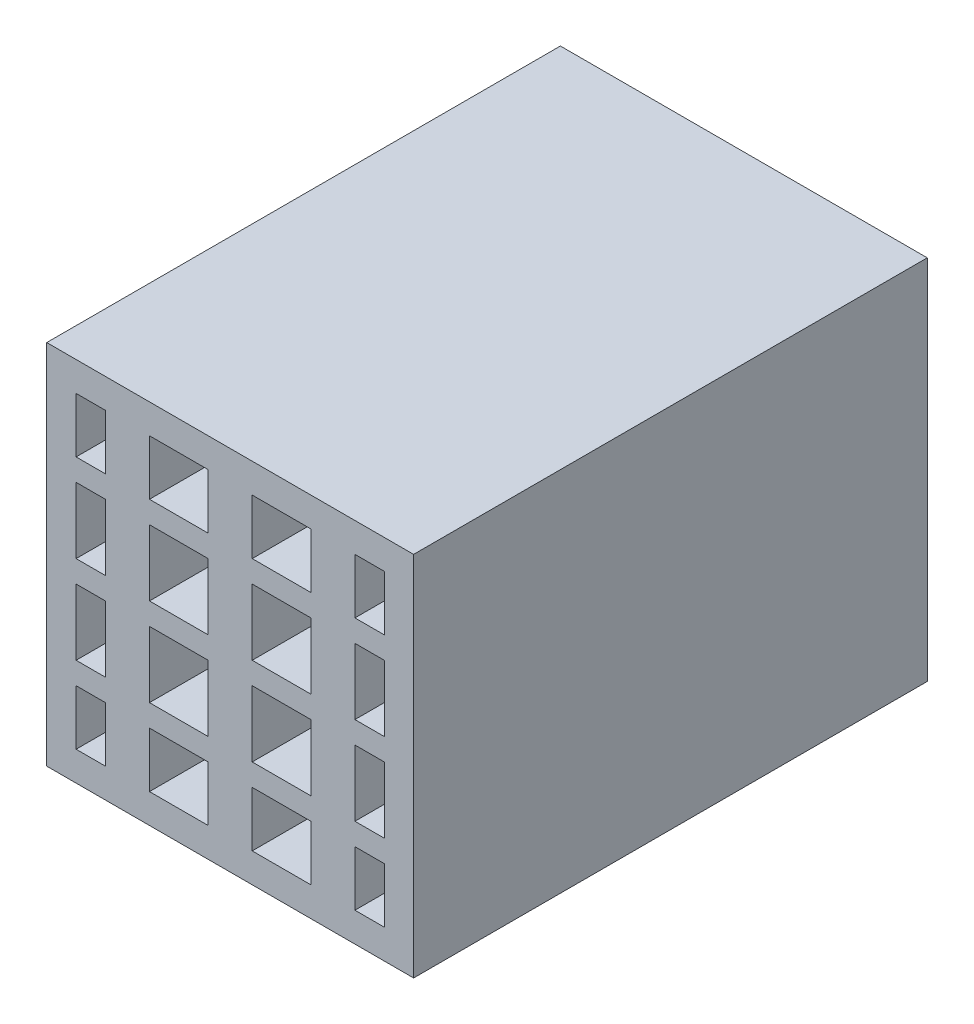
from build123d import *

# Parameters (mm, degrees)
SKETCH_8_W          = 25
SKETCH_8_H          = 25
SKETCH_8_W_2        = 4
SKETCH_8_H_2        = 21
SKETCH_8_W_3        = 2
EXTRUDE_7_DEPTH     = 25
SKETCH_9_W          = 25
SKETCH_9_H          = 25
EXTRUDE_8_DEPTH     = 2
SKETCH_11_W         = 25
SKETCH_11_H         = 25
EXTRUDE_9_DEPTH     = 6
SKETCH_12_W         = 21
SKETCH_12_H         = 21
CUT_EXTRUDE_1_DEPTH = 6
SKETCH_13_W         = 25
SKETCH_13_H         = 25
EXTRUDE_10_DEPTH    = 2
SKETCH_14_W         = 25
SKETCH_14_H         = 1.5
EXTRUDE_11_DEPTH    = 25


with BuildPart() as part:
    # Sketch 8 → Extrude 7 (new body)
    with BuildSketch(Plane.XY):
        Rectangle(SKETCH_8_W, SKETCH_8_H)
        with Locations((3.5, 0)):
            Rectangle(SKETCH_8_W_2, SKETCH_8_H_2, mode=Mode.SUBTRACT)
        with Locations((-3.5, 0)):
            Rectangle(SKETCH_8_W_2, SKETCH_8_H_2, mode=Mode.SUBTRACT)
        with Locations((-9.5, 0)):
            Rectangle(SKETCH_8_W_3, SKETCH_8_H_2, mode=Mode.SUBTRACT)
        with Locations((9.5, 0)):
            Rectangle(SKETCH_8_W_3, SKETCH_8_H_2, mode=Mode.SUBTRACT)
    extrude(amount=EXTRUDE_7_DEPTH)

    # Sketch 9 → Extrude 8 (add)
    with BuildSketch(Plane(origin=(0, 0, 0), x_dir=(-1, 0, 0), z_dir=(0, 0, -1))):
        Rectangle(SKETCH_9_W, SKETCH_9_H)
    extrude(amount=EXTRUDE_8_DEPTH)

    # Sketch 11 → Extrude 9 (add)
    with BuildSketch(Plane(origin=(0, 0, -2), x_dir=(-1, 0, 0), z_dir=(0, 0, -1))):
        Rectangle(SKETCH_11_W, SKETCH_11_H)
    extrude(amount=EXTRUDE_9_DEPTH)

    # Sketch 12 → Cut-Extrude 1 (cut)
    with BuildSketch(Plane(origin=(0, 0, -8), x_dir=(-1, 0, 0), z_dir=(0, 0, -1))):
        Rectangle(SKETCH_12_W, SKETCH_12_H)
    extrude(amount=-CUT_EXTRUDE_1_DEPTH, mode=Mode.SUBTRACT)

    # Sketch 13 → Extrude 10 (add)
    with BuildSketch(Plane(origin=(0, 0, -8), x_dir=(-1, 0, 0), z_dir=(0, 0, -1))):
        Rectangle(SKETCH_13_W, SKETCH_13_H)
    extrude(amount=EXTRUDE_10_DEPTH)

    # Sketch 14 → Extrude 11 (add)
    with BuildSketch(Plane.XY.offset(25)):
        Rectangle(SKETCH_14_W, SKETCH_14_H)
        with Locations((0, 6)):
            Rectangle(SKETCH_14_W, SKETCH_14_H)
        with Locations((0, -6)):
            Rectangle(SKETCH_14_W, SKETCH_14_H)
    extrude(amount=-EXTRUDE_11_DEPTH)


solid = part.part
